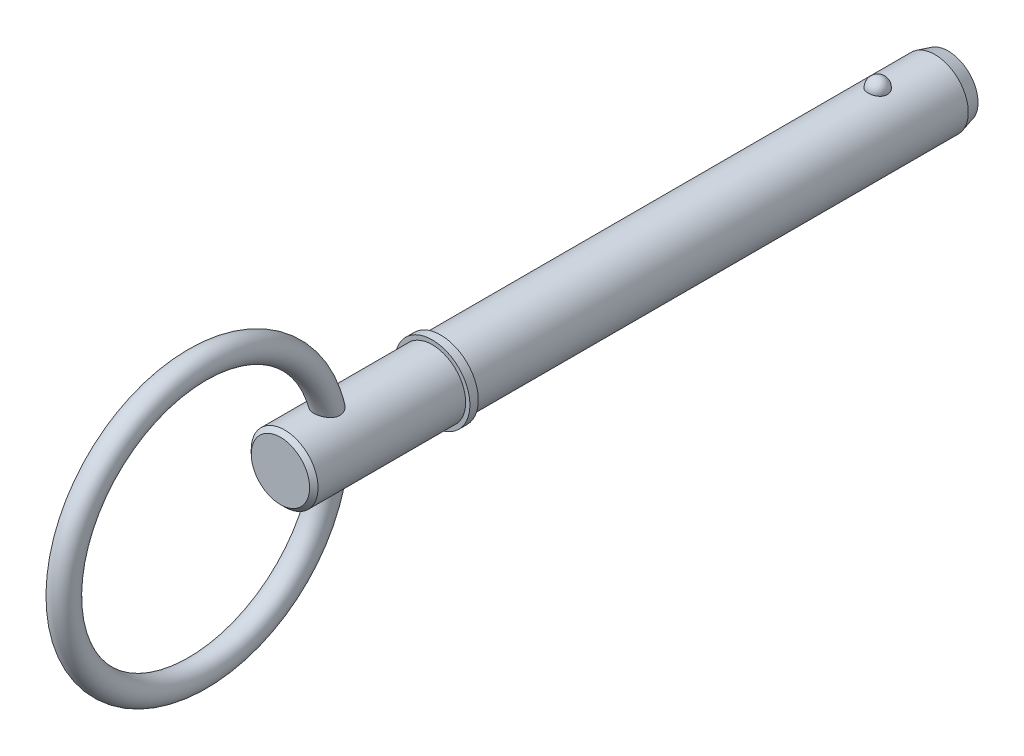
from build123d import *

# Parameters (mm, degrees)
SKETCH2_R           = 3.97
BOSS_EXTRUDE1_DEPTH = 50.8
BOSS_EXTRUDE2_START = 9.53
SKETCH3_R           = 3.97
BOSS_EXTRUDE2_DEPTH = 9.53
CHAMFER1_SIZE       = 1.586
CHAMFER1_SIZE2      = 0.424967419
SKETCH20_W          = 1
SKETCH20_H          = 4.47
SKETCH21_R          = 3.97
BOSS_EXTRUDE3_DEPTH = 19.05
CHAMFER2_SIZE       = 0.5
SKETCH24_R          = 1.5


with BuildPart() as part:
    # Sketch2 → Boss-Extrude1 (new body)
    with BuildSketch(Plane.XY):
        Circle(SKETCH2_R)
    extrude(amount=BOSS_EXTRUDE1_DEPTH)

    # Sketch3 → Boss-Extrude2 (add)
    with BuildSketch(Plane(origin=(0, 0, 0), x_dir=(-1, 0, 0), z_dir=(0, 0, -1)).offset(BOSS_EXTRUDE2_START)):
        Circle(SKETCH3_R)
    extrude(amount=-BOSS_EXTRUDE2_DEPTH)

    # Chamfer1
    chamfer1_edges = [part.edges().sort_by_distance(p)[0] for p in [
        (3.97, 0, -9.53),
    ]]
    chamfer1_side = [part.faces().sort_by_distance(p)[0] for p in [
        (3.97, 0, -4.765),
    ]]
    chamfer(chamfer1_edges, length=CHAMFER1_SIZE, length2=CHAMFER1_SIZE2, reference=chamfer1_side[0])

    # Sketch18 → Revolve1 (revolve)
    with BuildSketch(Plane(origin=(0, 0, 0), x_dir=(0, 0, -1), z_dir=(1, 0, 0))):
        with BuildLine():
            Line((1.15, 5.12), (1.15, 2.82))
            ThreePointArc((1.15, 2.82), (0, 3.97), (1.15, 5.12))
        make_face()
    revolve(axis=Axis((0, 5.12, -1.15), (0, -1, 0)))

    # Sketch20 → Revolve2 (revolve)
    with BuildSketch(Plane(origin=(0, 0, 0), x_dir=(0, 0, -1), z_dir=(1, 0, 0)), mode=Mode.PRIVATE) as revolve2_sk:
        with Locations((-51.3, 2.235)):
            Rectangle(SKETCH20_W, SKETCH20_H)
    revolve(revolve2_sk.sketch.rotate(Axis((0, 0, 33.728787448), (0, 0, 1)), 90), axis=Axis((0, 0, 33.728787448), (0, 0, 1)))

    # Sketch21 → Boss-Extrude3 (add)
    with BuildSketch(Plane(origin=(0, 0, 50.8), x_dir=(-1, 0, 0), z_dir=(0, 0, -1))):
        Circle(SKETCH21_R)
    extrude(amount=-BOSS_EXTRUDE3_DEPTH)

    # Chamfer2
    chamfer2_edges = [part.edges().sort_by_distance(p)[0] for p in [
        (3.97, 0, 69.85),
    ]]
    chamfer(chamfer2_edges, length=CHAMFER2_SIZE)

    # Sweep1: sweep along a path in Sketch23
    with BuildLine(Plane(origin=(0, 0, 0), x_dir=(0, 0, -1), z_dir=(1, 0, 0))) as sweep1_path:
        CenterArc((-79.725, 0), 15.875, 0, 360)
    # Sketch24 → Sweep1 (sweep)
    with BuildSketch(Plane(origin=(0, 0, 0), x_dir=(1, 0, 0), z_dir=(0, 1, 0))):
        with Locations((0, -63.85)):
            Circle(SKETCH24_R)
    sweep(path=sweep1_path.line)


solid = part.part
